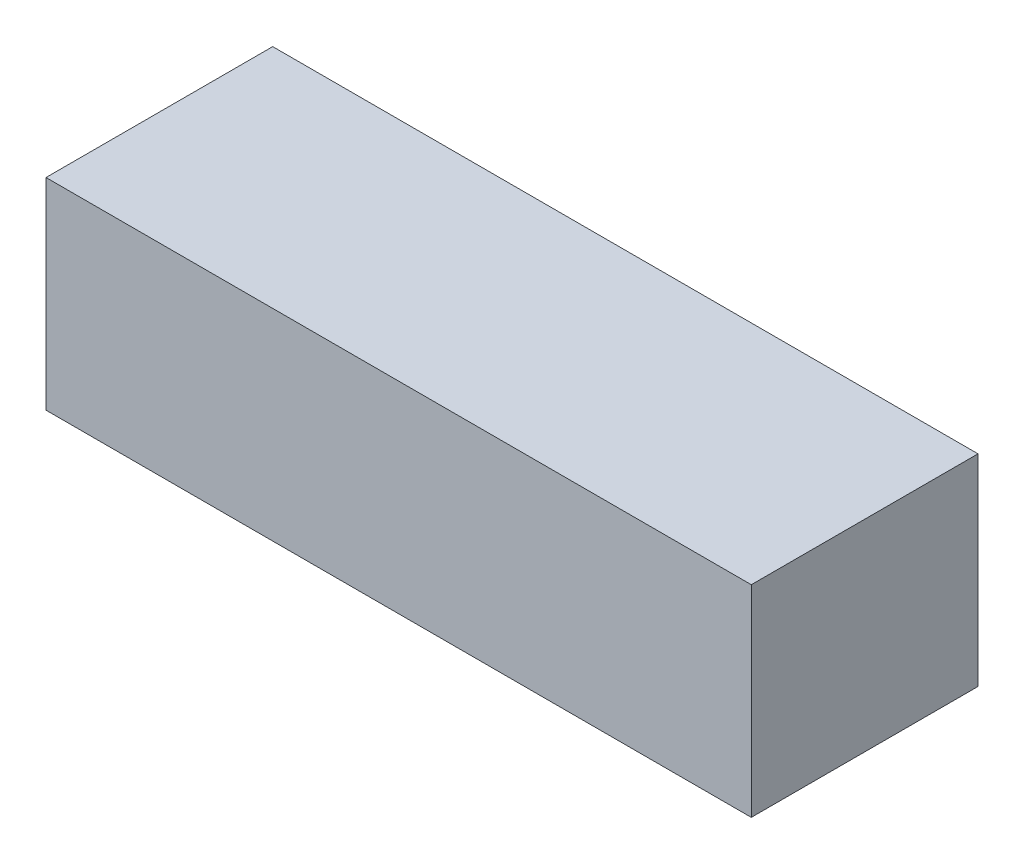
from build123d import *

# Parameters (mm, degrees)
SKETCH1_W      = 14
SKETCH1_H      = 4.5
EXTRUDE1_DEPTH = 4


with BuildPart() as part:
    # Sketch1 → Extrude1 (new body)
    with BuildSketch(Plane(origin=(0, 0, 0), x_dir=(1, 0, 0), z_dir=(0, 1, 0))):
        Rectangle(SKETCH1_W, SKETCH1_H)
    extrude(amount=EXTRUDE1_DEPTH)


solid = part.part
